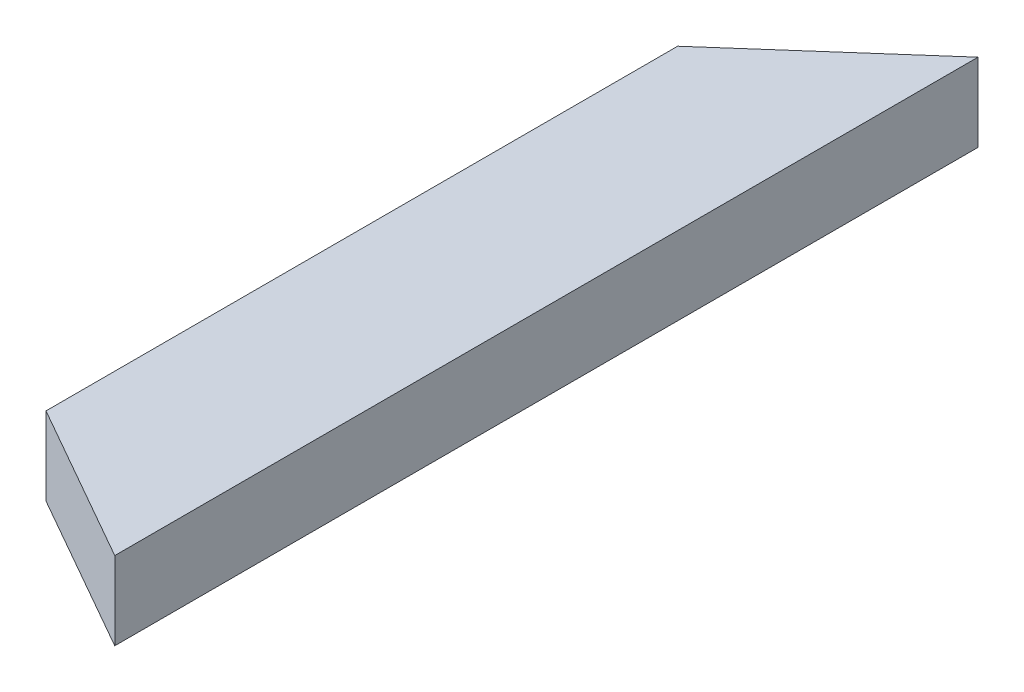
ISO-10303-21;
HEADER;
FILE_DESCRIPTION(('STEP AP214'),'2;1');
FILE_NAME('part.step','',(''),(''),'','','');
FILE_SCHEMA(('AUTOMOTIVE_DESIGN { 1 0 10303 214 1 1 1 1 }'));
ENDSEC;
DATA;
#1=APPLICATION_CONTEXT('core data for automotive mechanical design processes');
#2=APPLICATION_PROTOCOL_DEFINITION('international standard','automotive_design',2000,#1);
#3=PRODUCT_CONTEXT('',#1,'mechanical');
#4=PRODUCT('Part','Part','',(#3));
#5=PRODUCT_RELATED_PRODUCT_CATEGORY('part','',(#4));
#6=PRODUCT_DEFINITION_FORMATION('','',#4);
#7=PRODUCT_DEFINITION_CONTEXT('part definition',#1,'design');
#8=PRODUCT_DEFINITION('design','',#6,#7);
#9=PRODUCT_DEFINITION_SHAPE('','',#8);
#10=(LENGTH_UNIT() NAMED_UNIT(*) SI_UNIT(.MILLI.,.METRE.));
#11=(NAMED_UNIT(*) PLANE_ANGLE_UNIT() SI_UNIT($,.RADIAN.));
#12=(NAMED_UNIT(*) SI_UNIT($,.STERADIAN.) SOLID_ANGLE_UNIT());
#13=UNCERTAINTY_MEASURE_WITH_UNIT(LENGTH_MEASURE(1.E-05),#10,'distance_accuracy_value','');
#14=(GEOMETRIC_REPRESENTATION_CONTEXT(3) GLOBAL_UNCERTAINTY_ASSIGNED_CONTEXT((#13)) GLOBAL_UNIT_ASSIGNED_CONTEXT((#10,
#11,#12)) REPRESENTATION_CONTEXT('',''));
#15=CARTESIAN_POINT('',(0.,0.,0.));
#16=DIRECTION('',(0.,0.,1.));
#17=DIRECTION('',(1.,0.,0.));
#18=AXIS2_PLACEMENT_3D('',#15,#16,#17);
#19=CARTESIAN_POINT('',(-23.5,11.5,220.));
#20=DIRECTION('',(0.,-1.,0.));
#21=DIRECTION('',(0.,0.,-1.));
#22=AXIS2_PLACEMENT_3D('',#19,#20,#21);
#23=PLANE('',#22);
#24=DIRECTION('',(0.,0.,-1.));
#25=VECTOR('',#24,1.);
#26=CARTESIAN_POINT('',(-23.5,11.5,220.));
#27=LINE('',#26,#25);
#28=CARTESIAN_POINT('',(-23.5,11.5,206.619064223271));
#29=VERTEX_POINT('',#28);
#30=CARTESIAN_POINT('',(-23.5,11.5,20.7025138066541));
#31=VERTEX_POINT('',#30);
#32=EDGE_CURVE('E45',#29,#31,#27,.T.);
#33=ORIENTED_EDGE('',*,*,#32,.F.);
#34=DIRECTION('',(0.869000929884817,0.,0.494810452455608));
#35=VECTOR('',#34,1.);
#36=CARTESIAN_POINT('',(-94.597963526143,11.5,166.135775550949));
#37=LINE('',#36,#35);
#38=CARTESIAN_POINT('',(23.5,11.5,233.380935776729));
#39=VERTEX_POINT('',#38);
#40=EDGE_CURVE('E80',#29,#39,#37,.T.);
#41=ORIENTED_EDGE('',*,*,#40,.T.);
#42=DIRECTION('',(0.,0.,-1.));
#43=VECTOR('',#42,1.);
#44=CARTESIAN_POINT('',(23.5,11.5,220.));
#45=LINE('',#44,#43);
#46=CARTESIAN_POINT('',(23.5,11.5,-20.7025138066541));
#47=VERTEX_POINT('',#46);
#48=EDGE_CURVE('E11',#39,#47,#45,.T.);
#49=ORIENTED_EDGE('',*,*,#48,.T.);
#50=DIRECTION('',(0.750356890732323,0.,-0.661032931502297));
#51=VECTOR('',#50,1.);
#52=CARTESIAN_POINT('',(0.,11.5,0.));
#53=LINE('',#52,#51);
#54=EDGE_CURVE('E104',#31,#47,#53,.T.);
#55=ORIENTED_EDGE('',*,*,#54,.F.);
#56=EDGE_LOOP('',(#33,#41,#49,#55));
#57=FACE_BOUND('',#56,.T.);
#58=ADVANCED_FACE('F35',(#57),#23,.F.);
#59=CARTESIAN_POINT('',(-23.5,11.5,220.));
#60=DIRECTION('',(1.,0.,0.));
#61=DIRECTION('',(0.,1.,0.));
#62=AXIS2_PLACEMENT_3D('',#59,#60,#61);
#63=PLANE('',#62);
#64=DIRECTION('',(0.,0.,-1.));
#65=VECTOR('',#64,1.);
#66=CARTESIAN_POINT('',(-23.5,-11.5,220.));
#67=LINE('',#66,#65);
#68=CARTESIAN_POINT('',(-23.5,-11.5,206.619064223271));
#69=VERTEX_POINT('',#68);
#70=CARTESIAN_POINT('',(-23.5,-11.5,20.7025138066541));
#71=VERTEX_POINT('',#70);
#72=EDGE_CURVE('E75',#69,#71,#67,.T.);
#73=ORIENTED_EDGE('',*,*,#72,.F.);
#74=DIRECTION('',(0.,1.,0.));
#75=VECTOR('',#74,1.);
#76=CARTESIAN_POINT('',(-23.5,-11.5,206.619064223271));
#77=LINE('',#76,#75);
#78=EDGE_CURVE('E83',#69,#29,#77,.T.);
#79=ORIENTED_EDGE('',*,*,#78,.T.);
#80=ORIENTED_EDGE('',*,*,#32,.T.);
#81=DIRECTION('',(0.,1.,0.));
#82=VECTOR('',#81,1.);
#83=CARTESIAN_POINT('',(-23.5,-11.5,20.7025138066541));
#84=LINE('',#83,#82);
#85=EDGE_CURVE('E88',#71,#31,#84,.T.);
#86=ORIENTED_EDGE('',*,*,#85,.F.);
#87=EDGE_LOOP('',(#73,#79,#80,#86));
#88=FACE_BOUND('',#87,.T.);
#89=ADVANCED_FACE('F91',(#88),#63,.F.);
#90=CARTESIAN_POINT('',(-23.5,-11.5,220.));
#91=DIRECTION('',(0.,1.,0.));
#92=DIRECTION('',(0.,0.,1.));
#93=AXIS2_PLACEMENT_3D('',#90,#91,#92);
#94=PLANE('',#93);
#95=DIRECTION('',(0.869000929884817,0.,0.494810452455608));
#96=VECTOR('',#95,1.);
#97=CARTESIAN_POINT('',(-94.597963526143,-11.5,166.135775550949));
#98=LINE('',#97,#96);
#99=CARTESIAN_POINT('',(23.5,-11.5,233.380935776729));
#100=VERTEX_POINT('',#99);
#101=EDGE_CURVE('E71',#69,#100,#98,.T.);
#102=ORIENTED_EDGE('',*,*,#101,.F.);
#103=ORIENTED_EDGE('',*,*,#72,.T.);
#104=DIRECTION('',(0.750356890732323,0.,-0.661032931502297));
#105=VECTOR('',#104,1.);
#106=CARTESIAN_POINT('',(0.,-11.5,0.));
#107=LINE('',#106,#105);
#108=CARTESIAN_POINT('',(23.5,-11.5,-20.7025138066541));
#109=VERTEX_POINT('',#108);
#110=EDGE_CURVE('E107',#71,#109,#107,.T.);
#111=ORIENTED_EDGE('',*,*,#110,.T.);
#112=DIRECTION('',(0.,0.,-1.));
#113=VECTOR('',#112,1.);
#114=CARTESIAN_POINT('',(23.5,-11.5,220.));
#115=LINE('',#114,#113);
#116=EDGE_CURVE('E52',#100,#109,#115,.T.);
#117=ORIENTED_EDGE('',*,*,#116,.F.);
#118=EDGE_LOOP('',(#102,#103,#111,#117));
#119=FACE_BOUND('',#118,.T.);
#120=ADVANCED_FACE('F73',(#119),#94,.F.);
#121=CARTESIAN_POINT('',(23.5,11.5,220.));
#122=DIRECTION('',(-1.,0.,0.));
#123=DIRECTION('',(0.,-1.,0.));
#124=AXIS2_PLACEMENT_3D('',#121,#122,#123);
#125=PLANE('',#124);
#126=ORIENTED_EDGE('',*,*,#116,.T.);
#127=DIRECTION('',(0.,1.,0.));
#128=VECTOR('',#127,1.);
#129=CARTESIAN_POINT('',(23.5,-11.5,-20.7025138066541));
#130=LINE('',#129,#128);
#131=EDGE_CURVE('E99',#109,#47,#130,.T.);
#132=ORIENTED_EDGE('',*,*,#131,.T.);
#133=ORIENTED_EDGE('',*,*,#48,.F.);
#134=DIRECTION('',(0.,1.,0.));
#135=VECTOR('',#134,1.);
#136=CARTESIAN_POINT('',(23.5,-11.5,233.380935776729));
#137=LINE('',#136,#135);
#138=EDGE_CURVE('E79',#100,#39,#137,.T.);
#139=ORIENTED_EDGE('',*,*,#138,.F.);
#140=EDGE_LOOP('',(#126,#132,#133,#139));
#141=FACE_BOUND('',#140,.T.);
#142=ADVANCED_FACE('F37',(#141),#125,.F.);
#143=CARTESIAN_POINT('',(-94.597963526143,-11.5,166.135775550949));
#144=DIRECTION('',(-0.494810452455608,0.,0.869000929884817));
#145=DIRECTION('',(0.869000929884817,0.,0.494810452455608));
#146=AXIS2_PLACEMENT_3D('',#143,#144,#145);
#147=PLANE('',#146);
#148=ORIENTED_EDGE('',*,*,#40,.F.);
#149=ORIENTED_EDGE('',*,*,#78,.F.);
#150=ORIENTED_EDGE('',*,*,#101,.T.);
#151=ORIENTED_EDGE('',*,*,#138,.T.);
#152=EDGE_LOOP('',(#148,#149,#150,#151));
#153=FACE_BOUND('',#152,.T.);
#154=ADVANCED_FACE('F84',(#153),#147,.T.);
#155=CARTESIAN_POINT('',(0.,-11.5,0.));
#156=DIRECTION('',(0.661032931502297,0.,0.750356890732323));
#157=DIRECTION('',(0.750356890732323,0.,-0.661032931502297));
#158=AXIS2_PLACEMENT_3D('',#155,#156,#157);
#159=PLANE('',#158);
#160=ORIENTED_EDGE('',*,*,#54,.T.);
#161=ORIENTED_EDGE('',*,*,#131,.F.);
#162=ORIENTED_EDGE('',*,*,#110,.F.);
#163=ORIENTED_EDGE('',*,*,#85,.T.);
#164=EDGE_LOOP('',(#160,#161,#162,#163));
#165=FACE_BOUND('',#164,.T.);
#166=ADVANCED_FACE('F117',(#165),#159,.F.);
#167=CLOSED_SHELL('',(#58,#89,#120,#142,#154,#166));
#168=MANIFOLD_SOLID_BREP('B2',#167);
#169=ADVANCED_BREP_SHAPE_REPRESENTATION('',(#18,#168),#14);
#170=SHAPE_DEFINITION_REPRESENTATION(#9,#169);
ENDSEC;
END-ISO-10303-21;
